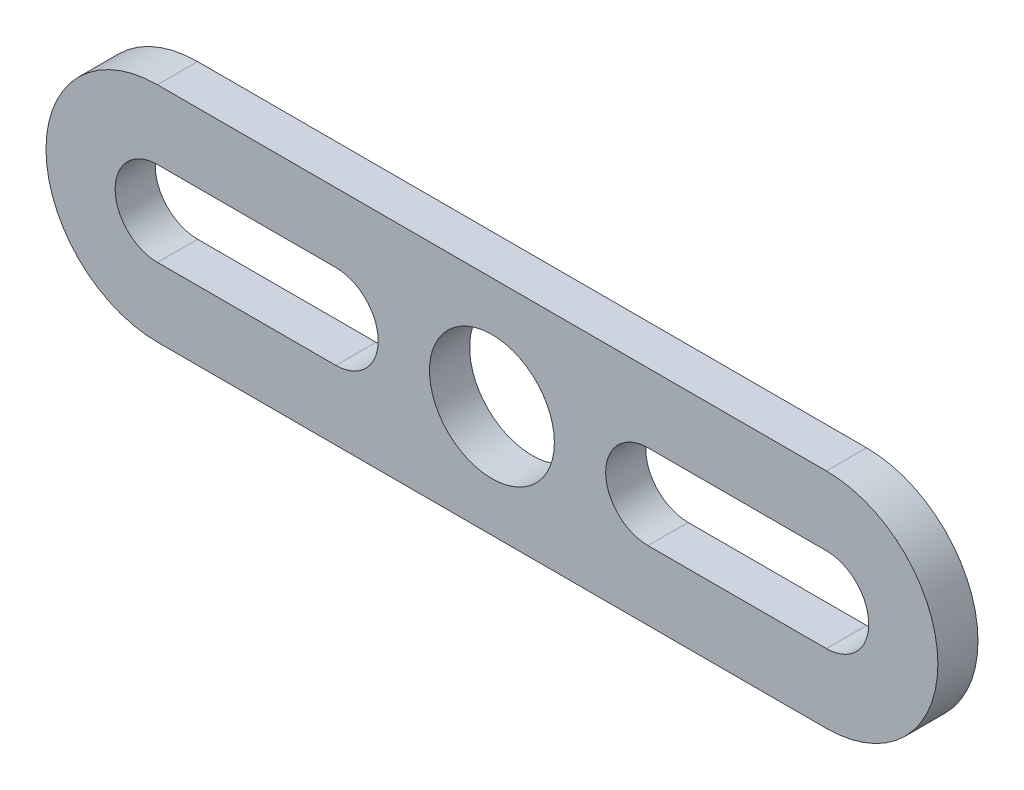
ISO-10303-21;
HEADER;
FILE_DESCRIPTION(('STEP AP214'),'2;1');
FILE_NAME('part.step','',(''),(''),'','','');
FILE_SCHEMA(('AUTOMOTIVE_DESIGN { 1 0 10303 214 1 1 1 1 }'));
ENDSEC;
DATA;
#1=APPLICATION_CONTEXT('core data for automotive mechanical design processes');
#2=APPLICATION_PROTOCOL_DEFINITION('international standard','automotive_design',2000,#1);
#3=PRODUCT_CONTEXT('',#1,'mechanical');
#4=PRODUCT('Part','Part','',(#3));
#5=PRODUCT_RELATED_PRODUCT_CATEGORY('part','',(#4));
#6=PRODUCT_DEFINITION_FORMATION('','',#4);
#7=PRODUCT_DEFINITION_CONTEXT('part definition',#1,'design');
#8=PRODUCT_DEFINITION('design','',#6,#7);
#9=PRODUCT_DEFINITION_SHAPE('','',#8);
#10=(LENGTH_UNIT() NAMED_UNIT(*) SI_UNIT(.MILLI.,.METRE.));
#11=(NAMED_UNIT(*) PLANE_ANGLE_UNIT() SI_UNIT($,.RADIAN.));
#12=(NAMED_UNIT(*) SI_UNIT($,.STERADIAN.) SOLID_ANGLE_UNIT());
#13=UNCERTAINTY_MEASURE_WITH_UNIT(LENGTH_MEASURE(1.E-05),#10,'distance_accuracy_value','');
#14=(GEOMETRIC_REPRESENTATION_CONTEXT(3) GLOBAL_UNCERTAINTY_ASSIGNED_CONTEXT((#13)) GLOBAL_UNIT_ASSIGNED_CONTEXT((#10,
#11,#12)) REPRESENTATION_CONTEXT('',''));
#15=CARTESIAN_POINT('',(0.,0.,0.));
#16=DIRECTION('',(0.,0.,1.));
#17=DIRECTION('',(1.,0.,0.));
#18=AXIS2_PLACEMENT_3D('',#15,#16,#17);
#19=CARTESIAN_POINT('',(-19.05,0.,2.286));
#20=DIRECTION('',(0.,0.,-1.));
#21=DIRECTION('',(-1.,0.,0.));
#22=AXIS2_PLACEMENT_3D('',#19,#20,#21);
#23=PLANE('',#22);
#24=CARTESIAN_POINT('',(0.,0.,2.286));
#25=DIRECTION('',(0.,0.,1.));
#26=DIRECTION('',(1.,0.,0.));
#27=AXIS2_PLACEMENT_3D('',#24,#25,#26);
#28=CIRCLE('',#27,3.556);
#29=CARTESIAN_POINT('',(3.556,0.,2.286));
#30=VERTEX_POINT('',#29);
#31=EDGE_CURVE('E292',#30,#30,#28,.T.);
#32=ORIENTED_EDGE('',*,*,#31,.F.);
#33=EDGE_LOOP('',(#32));
#34=FACE_BOUND('',#33,.T.);
#35=CARTESIAN_POINT('',(-19.05,0.,2.286));
#36=DIRECTION('',(0.,0.,1.));
#37=DIRECTION('',(-1.,0.,0.));
#38=AXIS2_PLACEMENT_3D('',#35,#36,#37);
#39=CIRCLE('',#38,6.35);
#40=CARTESIAN_POINT('',(-19.05,6.35,2.286));
#41=VERTEX_POINT('',#40);
#42=CARTESIAN_POINT('',(-19.05,-6.34999999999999,2.286));
#43=VERTEX_POINT('',#42);
#44=EDGE_CURVE('E196',#41,#43,#39,.T.);
#45=ORIENTED_EDGE('',*,*,#44,.T.);
#46=DIRECTION('',(1.,0.,0.));
#47=VECTOR('',#46,1.);
#48=CARTESIAN_POINT('',(-19.05,-6.34999999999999,2.286));
#49=LINE('',#48,#47);
#50=CARTESIAN_POINT('',(19.05,-6.34999999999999,2.286));
#51=VERTEX_POINT('',#50);
#52=EDGE_CURVE('E199',#43,#51,#49,.T.);
#53=ORIENTED_EDGE('',*,*,#52,.T.);
#54=CARTESIAN_POINT('',(19.05,0.,2.286));
#55=DIRECTION('',(0.,0.,1.));
#56=DIRECTION('',(-1.,0.,0.));
#57=AXIS2_PLACEMENT_3D('',#54,#55,#56);
#58=CIRCLE('',#57,6.35);
#59=CARTESIAN_POINT('',(19.05,6.35000000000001,2.286));
#60=VERTEX_POINT('',#59);
#61=EDGE_CURVE('E201',#51,#60,#58,.T.);
#62=ORIENTED_EDGE('',*,*,#61,.T.);
#63=DIRECTION('',(-1.,0.,0.));
#64=VECTOR('',#63,1.);
#65=CARTESIAN_POINT('',(-19.05,6.35,2.286));
#66=LINE('',#65,#64);
#67=EDGE_CURVE('E203',#60,#41,#66,.T.);
#68=ORIENTED_EDGE('',*,*,#67,.T.);
#69=EDGE_LOOP('',(#45,#53,#62,#68));
#70=FACE_BOUND('',#69,.T.);
#71=DIRECTION('',(1.,0.,0.));
#72=VECTOR('',#71,1.);
#73=CARTESIAN_POINT('',(8.89,-2.413,2.286));
#74=LINE('',#73,#72);
#75=CARTESIAN_POINT('',(8.89,-2.413,2.286));
#76=VERTEX_POINT('',#75);
#77=CARTESIAN_POINT('',(19.05,-2.413,2.286));
#78=VERTEX_POINT('',#77);
#79=EDGE_CURVE('E157',#76,#78,#74,.T.);
#80=ORIENTED_EDGE('',*,*,#79,.F.);
#81=CARTESIAN_POINT('',(8.89000000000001,0.,2.286));
#82=DIRECTION('',(0.,0.,1.));
#83=DIRECTION('',(1.,0.,0.));
#84=AXIS2_PLACEMENT_3D('',#81,#82,#83);
#85=CIRCLE('',#84,2.413);
#86=CARTESIAN_POINT('',(8.89000000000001,2.413,2.286));
#87=VERTEX_POINT('',#86);
#88=EDGE_CURVE('E153',#87,#76,#85,.T.);
#89=ORIENTED_EDGE('',*,*,#88,.F.);
#90=DIRECTION('',(-1.,0.,0.));
#91=VECTOR('',#90,1.);
#92=CARTESIAN_POINT('',(8.89000000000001,2.413,2.286));
#93=LINE('',#92,#91);
#94=CARTESIAN_POINT('',(19.05,2.413,2.286));
#95=VERTEX_POINT('',#94);
#96=EDGE_CURVE('E163',#95,#87,#93,.T.);
#97=ORIENTED_EDGE('',*,*,#96,.F.);
#98=CARTESIAN_POINT('',(19.05,0.,2.286));
#99=DIRECTION('',(0.,0.,1.));
#100=DIRECTION('',(-1.,0.,0.));
#101=AXIS2_PLACEMENT_3D('',#98,#99,#100);
#102=CIRCLE('',#101,2.413);
#103=EDGE_CURVE('E160',#78,#95,#102,.T.);
#104=ORIENTED_EDGE('',*,*,#103,.F.);
#105=EDGE_LOOP('',(#80,#89,#97,#104));
#106=FACE_BOUND('',#105,.T.);
#107=CARTESIAN_POINT('',(-8.89000000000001,0.,2.286));
#108=DIRECTION('',(0.,0.,-1.));
#109=DIRECTION('',(-1.,0.,0.));
#110=AXIS2_PLACEMENT_3D('',#107,#108,#109);
#111=CIRCLE('',#110,2.413);
#112=CARTESIAN_POINT('',(-8.89000000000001,2.413,2.286));
#113=VERTEX_POINT('',#112);
#114=CARTESIAN_POINT('',(-8.89000000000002,-2.413,2.286));
#115=VERTEX_POINT('',#114);
#116=EDGE_CURVE('E48',#113,#115,#111,.T.);
#117=ORIENTED_EDGE('',*,*,#116,.T.);
#118=DIRECTION('',(-1.,0.,0.));
#119=VECTOR('',#118,1.);
#120=CARTESIAN_POINT('',(-8.89000000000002,-2.413,2.286));
#121=LINE('',#120,#119);
#122=CARTESIAN_POINT('',(-19.05,-2.41300000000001,2.286));
#123=VERTEX_POINT('',#122);
#124=EDGE_CURVE('E139',#115,#123,#121,.T.);
#125=ORIENTED_EDGE('',*,*,#124,.T.);
#126=CARTESIAN_POINT('',(-19.05,0.,2.286));
#127=DIRECTION('',(0.,0.,-1.));
#128=DIRECTION('',(1.,0.,0.));
#129=AXIS2_PLACEMENT_3D('',#126,#127,#128);
#130=CIRCLE('',#129,2.413);
#131=CARTESIAN_POINT('',(-19.05,2.413,2.286));
#132=VERTEX_POINT('',#131);
#133=EDGE_CURVE('E126',#123,#132,#130,.T.);
#134=ORIENTED_EDGE('',*,*,#133,.T.);
#135=DIRECTION('',(1.,0.,0.));
#136=VECTOR('',#135,1.);
#137=CARTESIAN_POINT('',(-8.89000000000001,2.413,2.286));
#138=LINE('',#137,#136);
#139=EDGE_CURVE('E135',#132,#113,#138,.T.);
#140=ORIENTED_EDGE('',*,*,#139,.T.);
#141=EDGE_LOOP('',(#117,#125,#134,#140));
#142=FACE_BOUND('',#141,.T.);
#143=ADVANCED_FACE('F33',(#34,#70,#106,#142),#23,.F.);
#144=CARTESIAN_POINT('',(-19.05,0.,0.));
#145=DIRECTION('',(0.,0.,-1.));
#146=DIRECTION('',(-1.,0.,0.));
#147=AXIS2_PLACEMENT_3D('',#144,#145,#146);
#148=PLANE('',#147);
#149=CARTESIAN_POINT('',(0.,0.,0.));
#150=DIRECTION('',(0.,0.,1.));
#151=DIRECTION('',(1.,0.,0.));
#152=AXIS2_PLACEMENT_3D('',#149,#150,#151);
#153=CIRCLE('',#152,3.556);
#154=CARTESIAN_POINT('',(3.556,0.,0.));
#155=VERTEX_POINT('',#154);
#156=EDGE_CURVE('E290',#155,#155,#153,.T.);
#157=ORIENTED_EDGE('',*,*,#156,.T.);
#158=EDGE_LOOP('',(#157));
#159=FACE_BOUND('',#158,.T.);
#160=CARTESIAN_POINT('',(-19.05,0.,0.));
#161=DIRECTION('',(0.,0.,1.));
#162=DIRECTION('',(-1.,0.,0.));
#163=AXIS2_PLACEMENT_3D('',#160,#161,#162);
#164=CIRCLE('',#163,6.35);
#165=CARTESIAN_POINT('',(-19.05,6.35,0.));
#166=VERTEX_POINT('',#165);
#167=CARTESIAN_POINT('',(-19.05,-6.34999999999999,0.));
#168=VERTEX_POINT('',#167);
#169=EDGE_CURVE('E181',#166,#168,#164,.T.);
#170=ORIENTED_EDGE('',*,*,#169,.F.);
#171=DIRECTION('',(-1.,0.,0.));
#172=VECTOR('',#171,1.);
#173=CARTESIAN_POINT('',(-19.05,6.35,0.));
#174=LINE('',#173,#172);
#175=CARTESIAN_POINT('',(19.05,6.35000000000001,0.));
#176=VERTEX_POINT('',#175);
#177=EDGE_CURVE('E194',#176,#166,#174,.T.);
#178=ORIENTED_EDGE('',*,*,#177,.F.);
#179=CARTESIAN_POINT('',(19.05,0.,0.));
#180=DIRECTION('',(0.,0.,1.));
#181=DIRECTION('',(-1.,0.,0.));
#182=AXIS2_PLACEMENT_3D('',#179,#180,#181);
#183=CIRCLE('',#182,6.35);
#184=CARTESIAN_POINT('',(19.05,-6.34999999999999,0.));
#185=VERTEX_POINT('',#184);
#186=EDGE_CURVE('E192',#185,#176,#183,.T.);
#187=ORIENTED_EDGE('',*,*,#186,.F.);
#188=DIRECTION('',(1.,0.,0.));
#189=VECTOR('',#188,1.);
#190=CARTESIAN_POINT('',(-19.05,-6.34999999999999,0.));
#191=LINE('',#190,#189);
#192=EDGE_CURVE('E190',#168,#185,#191,.T.);
#193=ORIENTED_EDGE('',*,*,#192,.F.);
#194=EDGE_LOOP('',(#170,#178,#187,#193));
#195=FACE_BOUND('',#194,.T.);
#196=CARTESIAN_POINT('',(8.89000000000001,0.,0.));
#197=DIRECTION('',(0.,0.,1.));
#198=DIRECTION('',(1.,0.,0.));
#199=AXIS2_PLACEMENT_3D('',#196,#197,#198);
#200=CIRCLE('',#199,2.413);
#201=CARTESIAN_POINT('',(8.89000000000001,2.413,0.));
#202=VERTEX_POINT('',#201);
#203=CARTESIAN_POINT('',(8.89,-2.413,0.));
#204=VERTEX_POINT('',#203);
#205=EDGE_CURVE('E166',#202,#204,#200,.T.);
#206=ORIENTED_EDGE('',*,*,#205,.T.);
#207=DIRECTION('',(1.,0.,0.));
#208=VECTOR('',#207,1.);
#209=CARTESIAN_POINT('',(8.89,-2.413,0.));
#210=LINE('',#209,#208);
#211=CARTESIAN_POINT('',(19.05,-2.413,0.));
#212=VERTEX_POINT('',#211);
#213=EDGE_CURVE('E169',#204,#212,#210,.T.);
#214=ORIENTED_EDGE('',*,*,#213,.T.);
#215=CARTESIAN_POINT('',(19.05,0.,0.));
#216=DIRECTION('',(0.,0.,1.));
#217=DIRECTION('',(-1.,0.,0.));
#218=AXIS2_PLACEMENT_3D('',#215,#216,#217);
#219=CIRCLE('',#218,2.413);
#220=CARTESIAN_POINT('',(19.05,2.413,0.));
#221=VERTEX_POINT('',#220);
#222=EDGE_CURVE('E172',#212,#221,#219,.T.);
#223=ORIENTED_EDGE('',*,*,#222,.T.);
#224=DIRECTION('',(-1.,0.,0.));
#225=VECTOR('',#224,1.);
#226=CARTESIAN_POINT('',(8.89000000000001,2.413,0.));
#227=LINE('',#226,#225);
#228=EDGE_CURVE('E175',#221,#202,#227,.T.);
#229=ORIENTED_EDGE('',*,*,#228,.T.);
#230=EDGE_LOOP('',(#206,#214,#223,#229));
#231=FACE_BOUND('',#230,.T.);
#232=DIRECTION('',(-1.,0.,0.));
#233=VECTOR('',#232,1.);
#234=CARTESIAN_POINT('',(-8.89000000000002,-2.413,0.));
#235=LINE('',#234,#233);
#236=CARTESIAN_POINT('',(-8.89000000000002,-2.413,0.));
#237=VERTEX_POINT('',#236);
#238=CARTESIAN_POINT('',(-19.05,-2.413,0.));
#239=VERTEX_POINT('',#238);
#240=EDGE_CURVE('E149',#237,#239,#235,.T.);
#241=ORIENTED_EDGE('',*,*,#240,.F.);
#242=CARTESIAN_POINT('',(-8.89000000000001,0.,0.));
#243=DIRECTION('',(0.,0.,-1.));
#244=DIRECTION('',(-1.,0.,0.));
#245=AXIS2_PLACEMENT_3D('',#242,#243,#244);
#246=CIRCLE('',#245,2.413);
#247=CARTESIAN_POINT('',(-8.89000000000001,2.413,0.));
#248=VERTEX_POINT('',#247);
#249=EDGE_CURVE('E141',#248,#237,#246,.T.);
#250=ORIENTED_EDGE('',*,*,#249,.F.);
#251=DIRECTION('',(1.,0.,0.));
#252=VECTOR('',#251,1.);
#253=CARTESIAN_POINT('',(-8.89000000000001,2.413,0.));
#254=LINE('',#253,#252);
#255=CARTESIAN_POINT('',(-19.05,2.413,0.));
#256=VERTEX_POINT('',#255);
#257=EDGE_CURVE('E146',#256,#248,#254,.T.);
#258=ORIENTED_EDGE('',*,*,#257,.F.);
#259=CARTESIAN_POINT('',(-19.05,0.,0.));
#260=DIRECTION('',(0.,0.,-1.));
#261=DIRECTION('',(1.,0.,0.));
#262=AXIS2_PLACEMENT_3D('',#259,#260,#261);
#263=CIRCLE('',#262,2.413);
#264=EDGE_CURVE('E129',#239,#256,#263,.T.);
#265=ORIENTED_EDGE('',*,*,#264,.F.);
#266=EDGE_LOOP('',(#241,#250,#258,#265));
#267=FACE_BOUND('',#266,.T.);
#268=ADVANCED_FACE('F221',(#159,#195,#231,#267),#148,.T.);
#269=CARTESIAN_POINT('',(-19.05,0.,2.286));
#270=DIRECTION('',(0.,0.,-1.));
#271=DIRECTION('',(-1.,0.,0.));
#272=AXIS2_PLACEMENT_3D('',#269,#270,#271);
#273=CYLINDRICAL_SURFACE('',#272,6.35);
#274=ORIENTED_EDGE('',*,*,#169,.T.);
#275=DIRECTION('',(0.,0.,-1.));
#276=VECTOR('',#275,1.);
#277=CARTESIAN_POINT('',(-19.05,-6.34999999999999,2.286));
#278=LINE('',#277,#276);
#279=EDGE_CURVE('E11',#43,#168,#278,.T.);
#280=ORIENTED_EDGE('',*,*,#279,.F.);
#281=ORIENTED_EDGE('',*,*,#44,.F.);
#282=DIRECTION('',(0.,0.,-1.));
#283=VECTOR('',#282,1.);
#284=CARTESIAN_POINT('',(-19.05,6.35,2.286));
#285=LINE('',#284,#283);
#286=EDGE_CURVE('E205',#41,#166,#285,.T.);
#287=ORIENTED_EDGE('',*,*,#286,.T.);
#288=EDGE_LOOP('',(#274,#280,#281,#287));
#289=FACE_BOUND('',#288,.T.);
#290=ADVANCED_FACE('F35',(#289),#273,.T.);
#291=CARTESIAN_POINT('',(-19.05,-6.34999999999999,2.286));
#292=DIRECTION('',(0.,1.,0.));
#293=DIRECTION('',(0.,0.,1.));
#294=AXIS2_PLACEMENT_3D('',#291,#292,#293);
#295=PLANE('',#294);
#296=ORIENTED_EDGE('',*,*,#192,.T.);
#297=DIRECTION('',(0.,0.,-1.));
#298=VECTOR('',#297,1.);
#299=CARTESIAN_POINT('',(19.05,-6.34999999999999,2.286));
#300=LINE('',#299,#298);
#301=EDGE_CURVE('E41',#51,#185,#300,.T.);
#302=ORIENTED_EDGE('',*,*,#301,.F.);
#303=ORIENTED_EDGE('',*,*,#52,.F.);
#304=ORIENTED_EDGE('',*,*,#279,.T.);
#305=EDGE_LOOP('',(#296,#302,#303,#304));
#306=FACE_BOUND('',#305,.T.);
#307=ADVANCED_FACE('F232',(#306),#295,.F.);
#308=CARTESIAN_POINT('',(19.05,0.,2.286));
#309=DIRECTION('',(0.,0.,-1.));
#310=DIRECTION('',(-1.,0.,0.));
#311=AXIS2_PLACEMENT_3D('',#308,#309,#310);
#312=CYLINDRICAL_SURFACE('',#311,6.35);
#313=ORIENTED_EDGE('',*,*,#186,.T.);
#314=DIRECTION('',(0.,0.,-1.));
#315=VECTOR('',#314,1.);
#316=CARTESIAN_POINT('',(19.05,6.35000000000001,2.286));
#317=LINE('',#316,#315);
#318=EDGE_CURVE('E208',#60,#176,#317,.T.);
#319=ORIENTED_EDGE('',*,*,#318,.F.);
#320=ORIENTED_EDGE('',*,*,#61,.F.);
#321=ORIENTED_EDGE('',*,*,#301,.T.);
#322=EDGE_LOOP('',(#313,#319,#320,#321));
#323=FACE_BOUND('',#322,.T.);
#324=ADVANCED_FACE('F215',(#323),#312,.T.);
#325=CARTESIAN_POINT('',(-19.05,6.35,2.286));
#326=DIRECTION('',(0.,-1.,0.));
#327=DIRECTION('',(1.,0.,0.));
#328=AXIS2_PLACEMENT_3D('',#325,#326,#327);
#329=PLANE('',#328);
#330=ORIENTED_EDGE('',*,*,#177,.T.);
#331=ORIENTED_EDGE('',*,*,#286,.F.);
#332=ORIENTED_EDGE('',*,*,#67,.F.);
#333=ORIENTED_EDGE('',*,*,#318,.T.);
#334=EDGE_LOOP('',(#330,#331,#332,#333));
#335=FACE_BOUND('',#334,.T.);
#336=ADVANCED_FACE('F225',(#335),#329,.F.);
#337=CARTESIAN_POINT('',(8.89000000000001,0.,0.));
#338=DIRECTION('',(0.,0.,1.));
#339=DIRECTION('',(1.,0.,0.));
#340=AXIS2_PLACEMENT_3D('',#337,#338,#339);
#341=CYLINDRICAL_SURFACE('',#340,2.413);
#342=ORIENTED_EDGE('',*,*,#88,.T.);
#343=DIRECTION('',(0.,0.,1.));
#344=VECTOR('',#343,1.);
#345=CARTESIAN_POINT('',(8.89,-2.413,0.));
#346=LINE('',#345,#344);
#347=EDGE_CURVE('E178',#204,#76,#346,.T.);
#348=ORIENTED_EDGE('',*,*,#347,.F.);
#349=ORIENTED_EDGE('',*,*,#205,.F.);
#350=DIRECTION('',(0.,0.,1.));
#351=VECTOR('',#350,1.);
#352=CARTESIAN_POINT('',(8.89000000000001,2.413,0.));
#353=LINE('',#352,#351);
#354=EDGE_CURVE('E179',#202,#87,#353,.T.);
#355=ORIENTED_EDGE('',*,*,#354,.T.);
#356=EDGE_LOOP('',(#342,#348,#349,#355));
#357=FACE_BOUND('',#356,.T.);
#358=ADVANCED_FACE('F251',(#357),#341,.F.);
#359=CARTESIAN_POINT('',(8.89000000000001,2.413,0.));
#360=DIRECTION('',(0.,1.,0.));
#361=DIRECTION('',(0.,0.,1.));
#362=AXIS2_PLACEMENT_3D('',#359,#360,#361);
#363=PLANE('',#362);
#364=ORIENTED_EDGE('',*,*,#96,.T.);
#365=ORIENTED_EDGE('',*,*,#354,.F.);
#366=ORIENTED_EDGE('',*,*,#228,.F.);
#367=DIRECTION('',(0.,0.,1.));
#368=VECTOR('',#367,1.);
#369=CARTESIAN_POINT('',(19.05,2.413,0.));
#370=LINE('',#369,#368);
#371=EDGE_CURVE('E182',#221,#95,#370,.T.);
#372=ORIENTED_EDGE('',*,*,#371,.T.);
#373=EDGE_LOOP('',(#364,#365,#366,#372));
#374=FACE_BOUND('',#373,.T.);
#375=ADVANCED_FACE('F255',(#374),#363,.F.);
#376=CARTESIAN_POINT('',(19.05,0.,0.));
#377=DIRECTION('',(0.,0.,1.));
#378=DIRECTION('',(1.,0.,0.));
#379=AXIS2_PLACEMENT_3D('',#376,#377,#378);
#380=CYLINDRICAL_SURFACE('',#379,2.413);
#381=ORIENTED_EDGE('',*,*,#103,.T.);
#382=ORIENTED_EDGE('',*,*,#371,.F.);
#383=ORIENTED_EDGE('',*,*,#222,.F.);
#384=DIRECTION('',(0.,0.,1.));
#385=VECTOR('',#384,1.);
#386=CARTESIAN_POINT('',(19.05,-2.413,0.));
#387=LINE('',#386,#385);
#388=EDGE_CURVE('E184',#212,#78,#387,.T.);
#389=ORIENTED_EDGE('',*,*,#388,.T.);
#390=EDGE_LOOP('',(#381,#382,#383,#389));
#391=FACE_BOUND('',#390,.T.);
#392=ADVANCED_FACE('F260',(#391),#380,.F.);
#393=CARTESIAN_POINT('',(8.89,-2.413,0.));
#394=DIRECTION('',(0.,-1.,0.));
#395=DIRECTION('',(0.,0.,-1.));
#396=AXIS2_PLACEMENT_3D('',#393,#394,#395);
#397=PLANE('',#396);
#398=ORIENTED_EDGE('',*,*,#79,.T.);
#399=ORIENTED_EDGE('',*,*,#388,.F.);
#400=ORIENTED_EDGE('',*,*,#213,.F.);
#401=ORIENTED_EDGE('',*,*,#347,.T.);
#402=EDGE_LOOP('',(#398,#399,#400,#401));
#403=FACE_BOUND('',#402,.T.);
#404=ADVANCED_FACE('F264',(#403),#397,.F.);
#405=CARTESIAN_POINT('',(-8.89000000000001,0.,0.));
#406=DIRECTION('',(0.,0.,1.));
#407=DIRECTION('',(1.,0.,0.));
#408=AXIS2_PLACEMENT_3D('',#405,#406,#407);
#409=CYLINDRICAL_SURFACE('',#408,2.413);
#410=ORIENTED_EDGE('',*,*,#116,.F.);
#411=DIRECTION('',(0.,0.,1.));
#412=VECTOR('',#411,1.);
#413=CARTESIAN_POINT('',(-8.89000000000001,2.413,0.));
#414=LINE('',#413,#412);
#415=EDGE_CURVE('E132',#248,#113,#414,.T.);
#416=ORIENTED_EDGE('',*,*,#415,.F.);
#417=ORIENTED_EDGE('',*,*,#249,.T.);
#418=DIRECTION('',(0.,0.,1.));
#419=VECTOR('',#418,1.);
#420=CARTESIAN_POINT('',(-8.89000000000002,-2.413,0.));
#421=LINE('',#420,#419);
#422=EDGE_CURVE('E151',#237,#115,#421,.T.);
#423=ORIENTED_EDGE('',*,*,#422,.T.);
#424=EDGE_LOOP('',(#410,#416,#417,#423));
#425=FACE_BOUND('',#424,.T.);
#426=ADVANCED_FACE('F267',(#425),#409,.F.);
#427=CARTESIAN_POINT('',(-8.89000000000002,-2.413,0.));
#428=DIRECTION('',(0.,1.,0.));
#429=DIRECTION('',(0.,0.,1.));
#430=AXIS2_PLACEMENT_3D('',#427,#428,#429);
#431=PLANE('',#430);
#432=ORIENTED_EDGE('',*,*,#124,.F.);
#433=ORIENTED_EDGE('',*,*,#422,.F.);
#434=ORIENTED_EDGE('',*,*,#240,.T.);
#435=DIRECTION('',(0.,0.,1.));
#436=VECTOR('',#435,1.);
#437=CARTESIAN_POINT('',(-19.05,-2.413,0.));
#438=LINE('',#437,#436);
#439=EDGE_CURVE('E131',#239,#123,#438,.T.);
#440=ORIENTED_EDGE('',*,*,#439,.T.);
#441=EDGE_LOOP('',(#432,#433,#434,#440));
#442=FACE_BOUND('',#441,.T.);
#443=ADVANCED_FACE('F274',(#442),#431,.T.);
#444=CARTESIAN_POINT('',(-19.05,0.,0.));
#445=DIRECTION('',(0.,0.,1.));
#446=DIRECTION('',(1.,0.,0.));
#447=AXIS2_PLACEMENT_3D('',#444,#445,#446);
#448=CYLINDRICAL_SURFACE('',#447,2.413);
#449=ORIENTED_EDGE('',*,*,#133,.F.);
#450=ORIENTED_EDGE('',*,*,#439,.F.);
#451=ORIENTED_EDGE('',*,*,#264,.T.);
#452=DIRECTION('',(0.,0.,1.));
#453=VECTOR('',#452,1.);
#454=CARTESIAN_POINT('',(-19.05,2.413,0.));
#455=LINE('',#454,#453);
#456=EDGE_CURVE('E56',#256,#132,#455,.T.);
#457=ORIENTED_EDGE('',*,*,#456,.T.);
#458=EDGE_LOOP('',(#449,#450,#451,#457));
#459=FACE_BOUND('',#458,.T.);
#460=ADVANCED_FACE('F123',(#459),#448,.F.);
#461=CARTESIAN_POINT('',(-8.89000000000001,2.413,0.));
#462=DIRECTION('',(0.,-1.,0.));
#463=DIRECTION('',(0.,0.,-1.));
#464=AXIS2_PLACEMENT_3D('',#461,#462,#463);
#465=PLANE('',#464);
#466=ORIENTED_EDGE('',*,*,#139,.F.);
#467=ORIENTED_EDGE('',*,*,#456,.F.);
#468=ORIENTED_EDGE('',*,*,#257,.T.);
#469=ORIENTED_EDGE('',*,*,#415,.T.);
#470=EDGE_LOOP('',(#466,#467,#468,#469));
#471=FACE_BOUND('',#470,.T.);
#472=ADVANCED_FACE('F136',(#471),#465,.T.);
#473=CARTESIAN_POINT('',(0.,0.,0.));
#474=DIRECTION('',(0.,0.,1.));
#475=DIRECTION('',(1.,0.,0.));
#476=AXIS2_PLACEMENT_3D('',#473,#474,#475);
#477=CYLINDRICAL_SURFACE('',#476,3.556);
#478=ORIENTED_EDGE('',*,*,#156,.F.);
#479=EDGE_LOOP('',(#478));
#480=FACE_BOUND('',#479,.T.);
#481=ORIENTED_EDGE('',*,*,#31,.T.);
#482=EDGE_LOOP('',(#481));
#483=FACE_BOUND('',#482,.T.);
#484=ADVANCED_FACE('F277',(#480,#483),#477,.F.);
#485=CLOSED_SHELL('',(#143,#268,#290,#307,#324,#336,#358,#375,#392,#404,#426,#443,#460,#472,#484));
#486=MANIFOLD_SOLID_BREP('B2',#485);
#487=ADVANCED_BREP_SHAPE_REPRESENTATION('',(#18,#486),#14);
#488=SHAPE_DEFINITION_REPRESENTATION(#9,#487);
ENDSEC;
END-ISO-10303-21;
